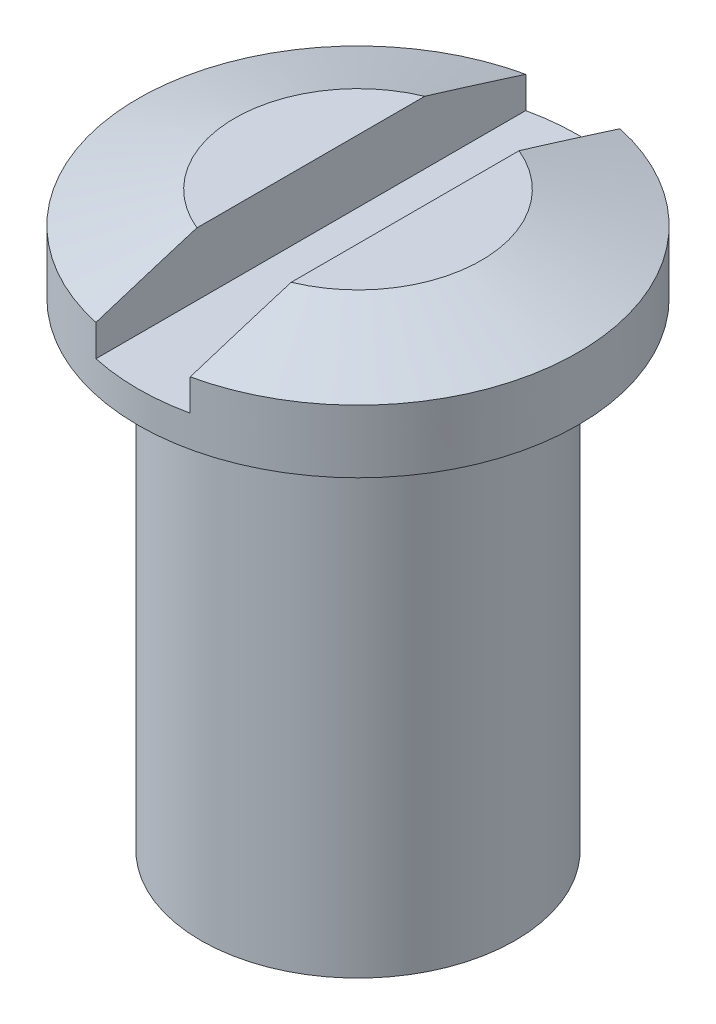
ISO-10303-21;
HEADER;
FILE_DESCRIPTION(('STEP AP214'),'2;1');
FILE_NAME('part.step','',(''),(''),'','','');
FILE_SCHEMA(('AUTOMOTIVE_DESIGN { 1 0 10303 214 1 1 1 1 }'));
ENDSEC;
DATA;
#1=APPLICATION_CONTEXT('core data for automotive mechanical design processes');
#2=APPLICATION_PROTOCOL_DEFINITION('international standard','automotive_design',2000,#1);
#3=PRODUCT_CONTEXT('',#1,'mechanical');
#4=PRODUCT('Part','Part','',(#3));
#5=PRODUCT_RELATED_PRODUCT_CATEGORY('part','',(#4));
#6=PRODUCT_DEFINITION_FORMATION('','',#4);
#7=PRODUCT_DEFINITION_CONTEXT('part definition',#1,'design');
#8=PRODUCT_DEFINITION('design','',#6,#7);
#9=PRODUCT_DEFINITION_SHAPE('','',#8);
#10=(LENGTH_UNIT() NAMED_UNIT(*) SI_UNIT(.MILLI.,.METRE.));
#11=(NAMED_UNIT(*) PLANE_ANGLE_UNIT() SI_UNIT($,.RADIAN.));
#12=(NAMED_UNIT(*) SI_UNIT($,.STERADIAN.) SOLID_ANGLE_UNIT());
#13=UNCERTAINTY_MEASURE_WITH_UNIT(LENGTH_MEASURE(1.E-05),#10,'distance_accuracy_value','');
#14=(GEOMETRIC_REPRESENTATION_CONTEXT(3) GLOBAL_UNCERTAINTY_ASSIGNED_CONTEXT((#13)) GLOBAL_UNIT_ASSIGNED_CONTEXT((#10,
#11,#12)) REPRESENTATION_CONTEXT('',''));
#15=CARTESIAN_POINT('',(0.,0.,0.));
#16=DIRECTION('',(0.,0.,1.));
#17=DIRECTION('',(1.,0.,0.));
#18=AXIS2_PLACEMENT_3D('',#15,#16,#17);
#19=CARTESIAN_POINT('',(-0.75,0.5,4.2));
#20=DIRECTION('',(0.,-1.,0.));
#21=DIRECTION('',(0.,0.,-1.));
#22=AXIS2_PLACEMENT_3D('',#19,#20,#21);
#23=PLANE('',#22);
#24=CARTESIAN_POINT('',(0.,0.5,0.));
#25=DIRECTION('',(0.,-1.,0.));
#26=DIRECTION('',(0.,0.,-1.));
#27=AXIS2_PLACEMENT_3D('',#24,#25,#26);
#28=CIRCLE('',#27,3.5);
#29=CARTESIAN_POINT('',(-0.75,0.5,-3.41869858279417));
#30=VERTEX_POINT('',#29);
#31=CARTESIAN_POINT('',(0.75,0.5,-3.41869858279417));
#32=VERTEX_POINT('',#31);
#33=EDGE_CURVE('E77',#30,#32,#28,.T.);
#34=ORIENTED_EDGE('',*,*,#33,.F.);
#35=DIRECTION('',(0.,0.,1.));
#36=VECTOR('',#35,1.);
#37=CARTESIAN_POINT('',(-0.75,0.5,4.2));
#38=LINE('',#37,#36);
#39=CARTESIAN_POINT('',(-0.75,0.5,3.41869858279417));
#40=VERTEX_POINT('',#39);
#41=EDGE_CURVE('E83',#30,#40,#38,.T.);
#42=ORIENTED_EDGE('',*,*,#41,.T.);
#43=CARTESIAN_POINT('',(0.,0.5,0.));
#44=DIRECTION('',(0.,-1.,0.));
#45=DIRECTION('',(0.,0.,-1.));
#46=AXIS2_PLACEMENT_3D('',#43,#44,#45);
#47=CIRCLE('',#46,3.5);
#48=CARTESIAN_POINT('',(0.75,0.5,3.41869858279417));
#49=VERTEX_POINT('',#48);
#50=EDGE_CURVE('E19',#49,#40,#47,.T.);
#51=ORIENTED_EDGE('',*,*,#50,.F.);
#52=DIRECTION('',(0.,0.,-1.));
#53=VECTOR('',#52,1.);
#54=CARTESIAN_POINT('',(0.75,0.5,4.2));
#55=LINE('',#54,#53);
#56=EDGE_CURVE('E76',#49,#32,#55,.T.);
#57=ORIENTED_EDGE('',*,*,#56,.T.);
#58=EDGE_LOOP('',(#34,#42,#51,#57));
#59=FACE_BOUND('',#58,.T.);
#60=ADVANCED_FACE('F16',(#59),#23,.F.);
#61=CARTESIAN_POINT('',(0.75,0.5,4.2));
#62=DIRECTION('',(1.,0.,0.));
#63=DIRECTION('',(0.,0.,-1.));
#64=AXIS2_PLACEMENT_3D('',#61,#62,#63);
#65=PLANE('',#64);
#66=DIRECTION('',(0.,0.,-1.));
#67=VECTOR('',#66,1.);
#68=CARTESIAN_POINT('',(0.75,1.5,0.));
#69=LINE('',#68,#67);
#70=CARTESIAN_POINT('',(0.75,1.49999999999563,1.81208211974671));
#71=VERTEX_POINT('',#70);
#72=CARTESIAN_POINT('',(0.75,1.49999999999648,-1.8120821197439));
#73=VERTEX_POINT('',#72);
#74=EDGE_CURVE('E89',#71,#73,#69,.T.);
#75=ORIENTED_EDGE('',*,*,#74,.T.);
#76=CARTESIAN_POINT('',(0.75,1.00000000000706,-3.41869858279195));
#77=CARTESIAN_POINT('',(0.75,1.04241002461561,-3.28504604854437));
#78=CARTESIAN_POINT('',(0.75,1.08473037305,-3.15136491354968));
#79=CARTESIAN_POINT('',(0.75,1.16906912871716,-2.88390941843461));
#80=CARTESIAN_POINT('',(0.75,1.21108753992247,-2.75013505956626));
#81=CARTESIAN_POINT('',(0.75,1.29470137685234,-2.48245222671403));
#82=CARTESIAN_POINT('',(0.75,1.33629679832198,-2.34854375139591));
#83=CARTESIAN_POINT('',(0.75,1.41876524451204,-2.08050281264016));
#84=CARTESIAN_POINT('',(0.75,1.45963825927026,-1.94637034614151));
#85=CARTESIAN_POINT('',(0.75,1.49999999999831,-1.81208211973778));
#86=B_SPLINE_CURVE_WITH_KNOTS('',3,(#76,#77,#78,#79,#80,#81,#82,#83,#84,#85),.UNSPECIFIED.,.F.,
.F.,(4,2,2,2,4),(0.,0.42065970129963,0.841313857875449,1.26197224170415,1.68263642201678),.UNSPECIFIED.);
#87=CARTESIAN_POINT('',(0.75,1.00000000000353,-3.41869858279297));
#88=VERTEX_POINT('',#87);
#89=EDGE_CURVE('E132',#88,#73,#86,.T.);
#90=ORIENTED_EDGE('',*,*,#89,.F.);
#91=DIRECTION('',(0.,1.,0.));
#92=VECTOR('',#91,1.);
#93=CARTESIAN_POINT('',(0.75,0.5,-3.418698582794));
#94=LINE('',#93,#92);
#95=EDGE_CURVE('E87',#32,#88,#94,.T.);
#96=ORIENTED_EDGE('',*,*,#95,.F.);
#97=ORIENTED_EDGE('',*,*,#56,.F.);
#98=DIRECTION('',(0.,1.,0.));
#99=VECTOR('',#98,1.);
#100=CARTESIAN_POINT('',(0.75,0.5,3.418698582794));
#101=LINE('',#100,#99);
#102=CARTESIAN_POINT('',(0.75,1.00000000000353,3.41869858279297));
#103=VERTEX_POINT('',#102);
#104=EDGE_CURVE('E66',#103,#49,#101,.F.);
#105=ORIENTED_EDGE('',*,*,#104,.F.);
#106=CARTESIAN_POINT('',(0.75,1.49999999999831,1.81208211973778));
#107=CARTESIAN_POINT('',(0.75,1.45963825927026,1.94637034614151));
#108=CARTESIAN_POINT('',(0.75,1.41876524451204,2.08050281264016));
#109=CARTESIAN_POINT('',(0.75,1.33629679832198,2.34854375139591));
#110=CARTESIAN_POINT('',(0.75,1.29470137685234,2.48245222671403));
#111=CARTESIAN_POINT('',(0.75,1.21108753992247,2.75013505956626));
#112=CARTESIAN_POINT('',(0.75,1.16906912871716,2.88390941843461));
#113=CARTESIAN_POINT('',(0.75,1.08473037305,3.15136491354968));
#114=CARTESIAN_POINT('',(0.75,1.04241002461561,3.28504604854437));
#115=CARTESIAN_POINT('',(0.75,1.00000000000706,3.41869858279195));
#116=B_SPLINE_CURVE_WITH_KNOTS('',3,(#106,#107,#108,#109,#110,#111,#112,#113,#114,#115),
.UNSPECIFIED.,.F.,.F.,(4,2,2,2,4),(0.,0.420664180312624,0.84132256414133,1.26197672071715,
1.68263642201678),.UNSPECIFIED.);
#117=EDGE_CURVE('E138',#71,#103,#116,.T.);
#118=ORIENTED_EDGE('',*,*,#117,.F.);
#119=EDGE_LOOP('',(#75,#90,#96,#97,#105,#118));
#120=FACE_BOUND('',#119,.T.);
#121=ADVANCED_FACE('F85',(#120),#65,.F.);
#122=CARTESIAN_POINT('',(0.,1.5,0.));
#123=DIRECTION('',(0.,-1.,0.));
#124=DIRECTION('',(0.,0.,-1.));
#125=AXIS2_PLACEMENT_3D('',#122,#123,#124);
#126=PLANE('',#125);
#127=ORIENTED_EDGE('',*,*,#74,.F.);
#128=CARTESIAN_POINT('',(0.,1.49999999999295,0.));
#129=DIRECTION('',(0.,-1.,0.));
#130=DIRECTION('',(0.,0.,-1.));
#131=AXIS2_PLACEMENT_3D('',#128,#129,#130);
#132=CIRCLE('',#131,1.96115823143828);
#133=EDGE_CURVE('E129',#73,#71,#132,.T.);
#134=ORIENTED_EDGE('',*,*,#133,.F.);
#135=EDGE_LOOP('',(#127,#134));
#136=FACE_BOUND('',#135,.T.);
#137=ADVANCED_FACE('F145',(#136),#126,.F.);
#138=CARTESIAN_POINT('',(0.,1.5,0.));
#139=DIRECTION('',(0.,-1.,0.));
#140=DIRECTION('',(0.,0.,-1.));
#141=AXIS2_PLACEMENT_3D('',#138,#139,#140);
#142=PLANE('',#141);
#143=DIRECTION('',(0.,0.,1.));
#144=VECTOR('',#143,1.);
#145=CARTESIAN_POINT('',(-0.75,1.5,4.2));
#146=LINE('',#145,#144);
#147=CARTESIAN_POINT('',(-0.75,1.49999999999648,1.8120821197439));
#148=VERTEX_POINT('',#147);
#149=CARTESIAN_POINT('',(-0.75,1.49999999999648,-1.8120821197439));
#150=VERTEX_POINT('',#149);
#151=EDGE_CURVE('E195',#148,#150,#146,.F.);
#152=ORIENTED_EDGE('',*,*,#151,.T.);
#153=CARTESIAN_POINT('',(0.,1.49999999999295,0.));
#154=DIRECTION('',(0.,-1.,0.));
#155=DIRECTION('',(0.,0.,-1.));
#156=AXIS2_PLACEMENT_3D('',#153,#154,#155);
#157=CIRCLE('',#156,1.96115823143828);
#158=EDGE_CURVE('E107',#148,#150,#157,.T.);
#159=ORIENTED_EDGE('',*,*,#158,.F.);
#160=EDGE_LOOP('',(#152,#159));
#161=FACE_BOUND('',#160,.T.);
#162=ADVANCED_FACE('F148',(#161),#142,.F.);
#163=CARTESIAN_POINT('',(-0.75,1.5,4.2));
#164=DIRECTION('',(-1.,0.,0.));
#165=DIRECTION('',(0.,0.,1.));
#166=AXIS2_PLACEMENT_3D('',#163,#164,#165);
#167=PLANE('',#166);
#168=DIRECTION('',(0.,1.,0.));
#169=VECTOR('',#168,1.);
#170=CARTESIAN_POINT('',(-0.75,1.5,-3.418698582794));
#171=LINE('',#170,#169);
#172=CARTESIAN_POINT('',(-0.75,1.00000000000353,-3.41869858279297));
#173=VERTEX_POINT('',#172);
#174=EDGE_CURVE('E34',#173,#30,#171,.F.);
#175=ORIENTED_EDGE('',*,*,#174,.F.);
#176=CARTESIAN_POINT('',(-0.75,1.49999999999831,-1.81208211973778));
#177=CARTESIAN_POINT('',(-0.75,1.45963825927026,-1.94637034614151));
#178=CARTESIAN_POINT('',(-0.75,1.41876524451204,-2.08050281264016));
#179=CARTESIAN_POINT('',(-0.75,1.33629679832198,-2.34854375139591));
#180=CARTESIAN_POINT('',(-0.75,1.29470137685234,-2.48245222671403));
#181=CARTESIAN_POINT('',(-0.75,1.21108753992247,-2.75013505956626));
#182=CARTESIAN_POINT('',(-0.75,1.16906912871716,-2.88390941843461));
#183=CARTESIAN_POINT('',(-0.75,1.08473037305,-3.15136491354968));
#184=CARTESIAN_POINT('',(-0.75,1.04241002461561,-3.28504604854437));
#185=CARTESIAN_POINT('',(-0.75,1.00000000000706,-3.41869858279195));
#186=B_SPLINE_CURVE_WITH_KNOTS('',3,(#176,#177,#178,#179,#180,#181,#182,#183,#184,#185),
.UNSPECIFIED.,.F.,.F.,(4,2,2,2,4),(0.,0.420664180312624,0.84132256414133,1.26197672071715,
1.68263642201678),.UNSPECIFIED.);
#187=EDGE_CURVE('E100',#150,#173,#186,.T.);
#188=ORIENTED_EDGE('',*,*,#187,.F.);
#189=ORIENTED_EDGE('',*,*,#151,.F.);
#190=CARTESIAN_POINT('',(-0.75,1.00000000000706,3.41869858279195));
#191=CARTESIAN_POINT('',(-0.75,1.04241002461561,3.28504604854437));
#192=CARTESIAN_POINT('',(-0.75,1.08473037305,3.15136491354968));
#193=CARTESIAN_POINT('',(-0.75,1.16906912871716,2.88390941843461));
#194=CARTESIAN_POINT('',(-0.75,1.21108753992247,2.75013505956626));
#195=CARTESIAN_POINT('',(-0.75,1.29470137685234,2.48245222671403));
#196=CARTESIAN_POINT('',(-0.75,1.33629679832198,2.34854375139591));
#197=CARTESIAN_POINT('',(-0.75,1.41876524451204,2.08050281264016));
#198=CARTESIAN_POINT('',(-0.75,1.45963825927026,1.94637034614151));
#199=CARTESIAN_POINT('',(-0.75,1.49999999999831,1.81208211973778));
#200=B_SPLINE_CURVE_WITH_KNOTS('',3,(#190,#191,#192,#193,#194,#195,#196,#197,#198,#199),
.UNSPECIFIED.,.F.,.F.,(4,2,2,2,4),(0.,0.420659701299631,0.841313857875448,1.26197224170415,
1.68263642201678),.UNSPECIFIED.);
#201=CARTESIAN_POINT('',(-0.75,1.00000000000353,3.41869858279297));
#202=VERTEX_POINT('',#201);
#203=EDGE_CURVE('E123',#202,#148,#200,.T.);
#204=ORIENTED_EDGE('',*,*,#203,.F.);
#205=DIRECTION('',(0.,1.,0.));
#206=VECTOR('',#205,1.);
#207=CARTESIAN_POINT('',(-0.75,1.5,3.418698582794));
#208=LINE('',#207,#206);
#209=EDGE_CURVE('E197',#40,#202,#208,.T.);
#210=ORIENTED_EDGE('',*,*,#209,.F.);
#211=ORIENTED_EDGE('',*,*,#41,.F.);
#212=EDGE_LOOP('',(#175,#188,#189,#204,#210,#211));
#213=FACE_BOUND('',#212,.T.);
#214=ADVANCED_FACE('F109',(#213),#167,.F.);
#215=CARTESIAN_POINT('',(0.,1.0000000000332,0.));
#216=DIRECTION('',(0.,-1.,0.));
#217=DIRECTION('',(0.,0.,-1.));
#218=AXIS2_PLACEMENT_3D('',#215,#216,#217);
#219=CONICAL_SURFACE('',#218,3.49999999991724,1.25663706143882);
#220=ORIENTED_EDGE('',*,*,#89,.T.);
#221=ORIENTED_EDGE('',*,*,#133,.T.);
#222=ORIENTED_EDGE('',*,*,#117,.T.);
#223=CARTESIAN_POINT('',(0.,1.,0.));
#224=DIRECTION('',(0.,-1.,0.));
#225=DIRECTION('',(0.,0.,-1.));
#226=AXIS2_PLACEMENT_3D('',#223,#224,#225);
#227=CIRCLE('',#226,3.5);
#228=EDGE_CURVE('E72',#88,#103,#227,.T.);
#229=ORIENTED_EDGE('',*,*,#228,.F.);
#230=EDGE_LOOP('',(#220,#221,#222,#229));
#231=FACE_BOUND('',#230,.T.);
#232=ADVANCED_FACE('F118',(#231),#219,.T.);
#233=CARTESIAN_POINT('',(0.,1.0000000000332,0.));
#234=DIRECTION('',(0.,-1.,0.));
#235=DIRECTION('',(0.,0.,-1.));
#236=AXIS2_PLACEMENT_3D('',#233,#234,#235);
#237=CONICAL_SURFACE('',#236,3.49999999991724,1.25663706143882);
#238=CARTESIAN_POINT('',(0.,1.,0.));
#239=DIRECTION('',(0.,-1.,0.));
#240=DIRECTION('',(0.,0.,-1.));
#241=AXIS2_PLACEMENT_3D('',#238,#239,#240);
#242=CIRCLE('',#241,3.5);
#243=EDGE_CURVE('E99',#202,#173,#242,.T.);
#244=ORIENTED_EDGE('',*,*,#243,.F.);
#245=ORIENTED_EDGE('',*,*,#203,.T.);
#246=ORIENTED_EDGE('',*,*,#158,.T.);
#247=ORIENTED_EDGE('',*,*,#187,.T.);
#248=EDGE_LOOP('',(#244,#245,#246,#247));
#249=FACE_BOUND('',#248,.T.);
#250=ADVANCED_FACE('F113',(#249),#237,.T.);
#251=CARTESIAN_POINT('',(0.,-8.,0.));
#252=DIRECTION('',(0.,-1.,0.));
#253=DIRECTION('',(0.,0.,-1.));
#254=AXIS2_PLACEMENT_3D('',#251,#252,#253);
#255=PLANE('',#254);
#256=CARTESIAN_POINT('',(0.,-7.99999999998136,0.));
#257=DIRECTION('',(0.,1.,0.));
#258=DIRECTION('',(0.,0.,1.));
#259=AXIS2_PLACEMENT_3D('',#256,#257,#258);
#260=CIRCLE('',#259,1.80717967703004);
#261=CARTESIAN_POINT('',(0.,-7.99999999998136,1.80717967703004));
#262=VERTEX_POINT('',#261);
#263=EDGE_CURVE('E96',#262,#262,#260,.T.);
#264=ORIENTED_EDGE('',*,*,#263,.F.);
#265=EDGE_LOOP('',(#264));
#266=FACE_BOUND('',#265,.T.);
#267=ADVANCED_FACE('F117',(#266),#255,.T.);
#268=CARTESIAN_POINT('',(0.,1.975,0.));
#269=DIRECTION('',(0.,-1.,0.));
#270=DIRECTION('',(0.,0.,-1.));
#271=AXIS2_PLACEMENT_3D('',#268,#269,#270);
#272=CYLINDRICAL_SURFACE('',#271,3.5);
#273=CARTESIAN_POINT('',(0.,0.,0.));
#274=DIRECTION('',(0.,-1.,0.));
#275=DIRECTION('',(0.,0.,-1.));
#276=AXIS2_PLACEMENT_3D('',#273,#274,#275);
#277=CIRCLE('',#276,3.5);
#278=CARTESIAN_POINT('',(0.,0.,-3.5));
#279=VERTEX_POINT('',#278);
#280=EDGE_CURVE('E93',#279,#279,#277,.T.);
#281=ORIENTED_EDGE('',*,*,#280,.F.);
#282=EDGE_LOOP('',(#281));
#283=FACE_BOUND('',#282,.T.);
#284=ORIENTED_EDGE('',*,*,#174,.T.);
#285=ORIENTED_EDGE('',*,*,#33,.T.);
#286=ORIENTED_EDGE('',*,*,#95,.T.);
#287=ORIENTED_EDGE('',*,*,#228,.T.);
#288=ORIENTED_EDGE('',*,*,#104,.T.);
#289=ORIENTED_EDGE('',*,*,#50,.T.);
#290=ORIENTED_EDGE('',*,*,#209,.T.);
#291=ORIENTED_EDGE('',*,*,#243,.T.);
#292=EDGE_LOOP('',(#284,#285,#286,#287,#288,#289,#290,#291));
#293=FACE_BOUND('',#292,.T.);
#294=ADVANCED_FACE('F68',(#283,#293),#272,.T.);
#295=CARTESIAN_POINT('',(0.,-7.60000000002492,0.));
#296=DIRECTION('',(0.,1.,0.));
#297=DIRECTION('',(0.,0.,1.));
#298=AXIS2_PLACEMENT_3D('',#295,#296,#297);
#299=CONICAL_SURFACE('',#298,2.49999999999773,1.04719755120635);
#300=ORIENTED_EDGE('',*,*,#263,.T.);
#301=EDGE_LOOP('',(#300));
#302=FACE_BOUND('',#301,.T.);
#303=CARTESIAN_POINT('',(0.,-7.6,0.));
#304=DIRECTION('',(0.,-1.,0.));
#305=DIRECTION('',(0.,0.,-1.));
#306=AXIS2_PLACEMENT_3D('',#303,#304,#305);
#307=CIRCLE('',#306,2.5);
#308=CARTESIAN_POINT('',(0.,-7.6,-2.5));
#309=VERTEX_POINT('',#308);
#310=EDGE_CURVE('E25',#309,#309,#307,.F.);
#311=ORIENTED_EDGE('',*,*,#310,.F.);
#312=EDGE_LOOP('',(#311));
#313=FACE_BOUND('',#312,.T.);
#314=ADVANCED_FACE('F164',(#302,#313),#299,.T.);
#315=CARTESIAN_POINT('',(0.,0.,0.));
#316=DIRECTION('',(0.,-1.,0.));
#317=DIRECTION('',(0.,0.,-1.));
#318=AXIS2_PLACEMENT_3D('',#315,#316,#317);
#319=PLANE('',#318);
#320=CARTESIAN_POINT('',(0.,0.,0.));
#321=DIRECTION('',(0.,-1.,0.));
#322=DIRECTION('',(0.,0.,-1.));
#323=AXIS2_PLACEMENT_3D('',#320,#321,#322);
#324=CIRCLE('',#323,2.5);
#325=CARTESIAN_POINT('',(0.,0.,-2.5));
#326=VERTEX_POINT('',#325);
#327=EDGE_CURVE('E11',#326,#326,#324,.T.);
#328=ORIENTED_EDGE('',*,*,#327,.F.);
#329=EDGE_LOOP('',(#328));
#330=FACE_BOUND('',#329,.T.);
#331=ORIENTED_EDGE('',*,*,#280,.T.);
#332=EDGE_LOOP('',(#331));
#333=FACE_BOUND('',#332,.T.);
#334=ADVANCED_FACE('F158',(#330,#333),#319,.T.);
#335=CARTESIAN_POINT('',(0.,1.975,0.));
#336=DIRECTION('',(0.,-1.,0.));
#337=DIRECTION('',(0.,0.,-1.));
#338=AXIS2_PLACEMENT_3D('',#335,#336,#337);
#339=CYLINDRICAL_SURFACE('',#338,2.5);
#340=ORIENTED_EDGE('',*,*,#327,.T.);
#341=EDGE_LOOP('',(#340));
#342=FACE_BOUND('',#341,.T.);
#343=ORIENTED_EDGE('',*,*,#310,.T.);
#344=EDGE_LOOP('',(#343));
#345=FACE_BOUND('',#344,.T.);
#346=ADVANCED_FACE('F156',(#342,#345),#339,.T.);
#347=CLOSED_SHELL('',(#60,#121,#137,#162,#214,#232,#250,#267,#294,#314,#334,#346));
#348=MANIFOLD_SOLID_BREP('B1',#347);
#349=ADVANCED_BREP_SHAPE_REPRESENTATION('',(#18,#348),#14);
#350=SHAPE_DEFINITION_REPRESENTATION(#9,#349);
ENDSEC;
END-ISO-10303-21;
